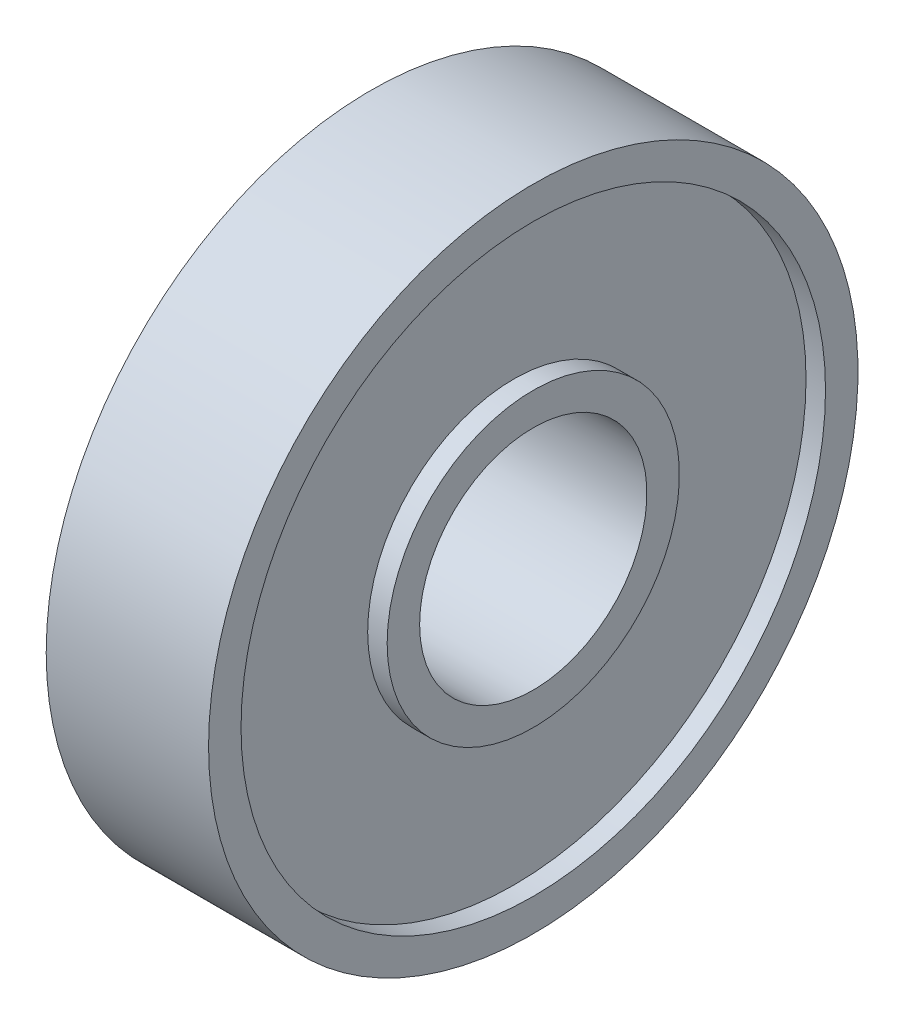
ISO-10303-21;
HEADER;
FILE_DESCRIPTION(('STEP AP214'),'2;1');
FILE_NAME('part.step','',(''),(''),'','','');
FILE_SCHEMA(('AUTOMOTIVE_DESIGN { 1 0 10303 214 1 1 1 1 }'));
ENDSEC;
DATA;
#1=APPLICATION_CONTEXT('core data for automotive mechanical design processes');
#2=APPLICATION_PROTOCOL_DEFINITION('international standard','automotive_design',2000,#1);
#3=PRODUCT_CONTEXT('',#1,'mechanical');
#4=PRODUCT('Part','Part','',(#3));
#5=PRODUCT_RELATED_PRODUCT_CATEGORY('part','',(#4));
#6=PRODUCT_DEFINITION_FORMATION('','',#4);
#7=PRODUCT_DEFINITION_CONTEXT('part definition',#1,'design');
#8=PRODUCT_DEFINITION('design','',#6,#7);
#9=PRODUCT_DEFINITION_SHAPE('','',#8);
#10=(LENGTH_UNIT() NAMED_UNIT(*) SI_UNIT(.MILLI.,.METRE.));
#11=(NAMED_UNIT(*) PLANE_ANGLE_UNIT() SI_UNIT($,.RADIAN.));
#12=(NAMED_UNIT(*) SI_UNIT($,.STERADIAN.) SOLID_ANGLE_UNIT());
#13=UNCERTAINTY_MEASURE_WITH_UNIT(LENGTH_MEASURE(1.E-05),#10,'distance_accuracy_value','');
#14=(GEOMETRIC_REPRESENTATION_CONTEXT(3) GLOBAL_UNCERTAINTY_ASSIGNED_CONTEXT((#13)) GLOBAL_UNIT_ASSIGNED_CONTEXT((#10,
#11,#12)) REPRESENTATION_CONTEXT('',''));
#15=CARTESIAN_POINT('',(0.,0.,0.));
#16=DIRECTION('',(0.,0.,1.));
#17=DIRECTION('',(1.,0.,0.));
#18=AXIS2_PLACEMENT_3D('',#15,#16,#17);
#19=CARTESIAN_POINT('',(3.,45.,0.));
#20=DIRECTION('',(1.,0.,0.));
#21=DIRECTION('',(0.,0.,-1.));
#22=AXIS2_PLACEMENT_3D('',#19,#20,#21);
#23=PLANE('',#22);
#24=CARTESIAN_POINT('',(3.,0.,0.));
#25=DIRECTION('',(-1.,0.,0.));
#26=DIRECTION('',(0.,0.,1.));
#27=AXIS2_PLACEMENT_3D('',#24,#25,#26);
#28=CIRCLE('',#27,22.5);
#29=CARTESIAN_POINT('',(3.,0.,22.5));
#30=VERTEX_POINT('',#29);
#31=EDGE_CURVE('E10',#30,#30,#28,.T.);
#32=ORIENTED_EDGE('',*,*,#31,.F.);
#33=EDGE_LOOP('',(#32));
#34=FACE_BOUND('',#33,.T.);
#35=CARTESIAN_POINT('',(3.,0.,0.));
#36=DIRECTION('',(-1.,0.,0.));
#37=DIRECTION('',(0.,0.,1.));
#38=AXIS2_PLACEMENT_3D('',#35,#36,#37);
#39=CIRCLE('',#38,45.);
#40=CARTESIAN_POINT('',(3.,0.,45.));
#41=VERTEX_POINT('',#40);
#42=EDGE_CURVE('E69',#41,#41,#39,.T.);
#43=ORIENTED_EDGE('',*,*,#42,.T.);
#44=EDGE_LOOP('',(#43));
#45=FACE_BOUND('',#44,.T.);
#46=ADVANCED_FACE('F29',(#34,#45),#23,.F.);
#47=CARTESIAN_POINT('',(-3.79526862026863,0.,0.));
#48=DIRECTION('',(-1.,0.,0.));
#49=DIRECTION('',(0.,0.,1.));
#50=AXIS2_PLACEMENT_3D('',#47,#48,#49);
#51=CYLINDRICAL_SURFACE('',#50,22.5);
#52=CARTESIAN_POINT('',(0.,0.,0.));
#53=DIRECTION('',(-1.,0.,0.));
#54=DIRECTION('',(0.,0.,1.));
#55=AXIS2_PLACEMENT_3D('',#52,#53,#54);
#56=CIRCLE('',#55,22.5);
#57=CARTESIAN_POINT('',(0.,0.,22.5));
#58=VERTEX_POINT('',#57);
#59=EDGE_CURVE('E35',#58,#58,#56,.T.);
#60=ORIENTED_EDGE('',*,*,#59,.F.);
#61=EDGE_LOOP('',(#60));
#62=FACE_BOUND('',#61,.T.);
#63=ORIENTED_EDGE('',*,*,#31,.T.);
#64=EDGE_LOOP('',(#63));
#65=FACE_BOUND('',#64,.T.);
#66=ADVANCED_FACE('F130',(#62,#65),#51,.T.);
#67=CARTESIAN_POINT('',(0.,22.5,0.));
#68=DIRECTION('',(1.,0.,0.));
#69=DIRECTION('',(0.,0.,-1.));
#70=AXIS2_PLACEMENT_3D('',#67,#68,#69);
#71=PLANE('',#70);
#72=CARTESIAN_POINT('',(0.,0.,0.));
#73=DIRECTION('',(-1.,0.,0.));
#74=DIRECTION('',(0.,0.,1.));
#75=AXIS2_PLACEMENT_3D('',#72,#73,#74);
#76=CIRCLE('',#75,17.5);
#77=CARTESIAN_POINT('',(0.,0.,17.5));
#78=VERTEX_POINT('',#77);
#79=EDGE_CURVE('E39',#78,#78,#76,.T.);
#80=ORIENTED_EDGE('',*,*,#79,.F.);
#81=EDGE_LOOP('',(#80));
#82=FACE_BOUND('',#81,.T.);
#83=ORIENTED_EDGE('',*,*,#59,.T.);
#84=EDGE_LOOP('',(#83));
#85=FACE_BOUND('',#84,.T.);
#86=ADVANCED_FACE('F125',(#82,#85),#71,.F.);
#87=CARTESIAN_POINT('',(-3.79526862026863,0.,0.));
#88=DIRECTION('',(-1.,0.,0.));
#89=DIRECTION('',(0.,0.,1.));
#90=AXIS2_PLACEMENT_3D('',#87,#88,#89);
#91=CYLINDRICAL_SURFACE('',#90,17.5);
#92=CARTESIAN_POINT('',(25.,0.,0.));
#93=DIRECTION('',(-1.,0.,0.));
#94=DIRECTION('',(0.,0.,1.));
#95=AXIS2_PLACEMENT_3D('',#92,#93,#94);
#96=CIRCLE('',#95,17.5);
#97=CARTESIAN_POINT('',(25.,0.,17.5));
#98=VERTEX_POINT('',#97);
#99=EDGE_CURVE('E43',#98,#98,#96,.T.);
#100=ORIENTED_EDGE('',*,*,#99,.F.);
#101=EDGE_LOOP('',(#100));
#102=FACE_BOUND('',#101,.T.);
#103=ORIENTED_EDGE('',*,*,#79,.T.);
#104=EDGE_LOOP('',(#103));
#105=FACE_BOUND('',#104,.T.);
#106=ADVANCED_FACE('F119',(#102,#105),#91,.F.);
#107=CARTESIAN_POINT('',(25.,22.5,0.));
#108=DIRECTION('',(-1.,0.,0.));
#109=DIRECTION('',(0.,0.,1.));
#110=AXIS2_PLACEMENT_3D('',#107,#108,#109);
#111=PLANE('',#110);
#112=CARTESIAN_POINT('',(25.,0.,0.));
#113=DIRECTION('',(-1.,0.,0.));
#114=DIRECTION('',(0.,0.,1.));
#115=AXIS2_PLACEMENT_3D('',#112,#113,#114);
#116=CIRCLE('',#115,22.5);
#117=CARTESIAN_POINT('',(25.,0.,22.5));
#118=VERTEX_POINT('',#117);
#119=EDGE_CURVE('E48',#118,#118,#116,.T.);
#120=ORIENTED_EDGE('',*,*,#119,.F.);
#121=EDGE_LOOP('',(#120));
#122=FACE_BOUND('',#121,.T.);
#123=ORIENTED_EDGE('',*,*,#99,.T.);
#124=EDGE_LOOP('',(#123));
#125=FACE_BOUND('',#124,.T.);
#126=ADVANCED_FACE('F113',(#122,#125),#111,.F.);
#127=CARTESIAN_POINT('',(-3.79526862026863,0.,0.));
#128=DIRECTION('',(-1.,0.,0.));
#129=DIRECTION('',(0.,0.,1.));
#130=AXIS2_PLACEMENT_3D('',#127,#128,#129);
#131=CYLINDRICAL_SURFACE('',#130,22.5);
#132=CARTESIAN_POINT('',(22.,0.,0.));
#133=DIRECTION('',(-1.,0.,0.));
#134=DIRECTION('',(0.,0.,1.));
#135=AXIS2_PLACEMENT_3D('',#132,#133,#134);
#136=CIRCLE('',#135,22.5);
#137=CARTESIAN_POINT('',(22.,0.,22.5));
#138=VERTEX_POINT('',#137);
#139=EDGE_CURVE('E51',#138,#138,#136,.T.);
#140=ORIENTED_EDGE('',*,*,#139,.F.);
#141=EDGE_LOOP('',(#140));
#142=FACE_BOUND('',#141,.T.);
#143=ORIENTED_EDGE('',*,*,#119,.T.);
#144=EDGE_LOOP('',(#143));
#145=FACE_BOUND('',#144,.T.);
#146=ADVANCED_FACE('F107',(#142,#145),#131,.T.);
#147=CARTESIAN_POINT('',(22.,45.,0.));
#148=DIRECTION('',(-1.,0.,0.));
#149=DIRECTION('',(0.,0.,1.));
#150=AXIS2_PLACEMENT_3D('',#147,#148,#149);
#151=PLANE('',#150);
#152=CARTESIAN_POINT('',(22.,0.,0.));
#153=DIRECTION('',(-1.,0.,0.));
#154=DIRECTION('',(0.,0.,1.));
#155=AXIS2_PLACEMENT_3D('',#152,#153,#154);
#156=CIRCLE('',#155,45.);
#157=CARTESIAN_POINT('',(22.,0.,45.));
#158=VERTEX_POINT('',#157);
#159=EDGE_CURVE('E54',#158,#158,#156,.T.);
#160=ORIENTED_EDGE('',*,*,#159,.F.);
#161=EDGE_LOOP('',(#160));
#162=FACE_BOUND('',#161,.T.);
#163=ORIENTED_EDGE('',*,*,#139,.T.);
#164=EDGE_LOOP('',(#163));
#165=FACE_BOUND('',#164,.T.);
#166=ADVANCED_FACE('F101',(#162,#165),#151,.F.);
#167=CARTESIAN_POINT('',(-3.79526862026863,0.,0.));
#168=DIRECTION('',(-1.,0.,0.));
#169=DIRECTION('',(0.,0.,1.));
#170=AXIS2_PLACEMENT_3D('',#167,#168,#169);
#171=CYLINDRICAL_SURFACE('',#170,45.);
#172=CARTESIAN_POINT('',(25.,0.,0.));
#173=DIRECTION('',(-1.,0.,0.));
#174=DIRECTION('',(0.,0.,1.));
#175=AXIS2_PLACEMENT_3D('',#172,#173,#174);
#176=CIRCLE('',#175,45.);
#177=CARTESIAN_POINT('',(25.,0.,45.));
#178=VERTEX_POINT('',#177);
#179=EDGE_CURVE('E57',#178,#178,#176,.T.);
#180=ORIENTED_EDGE('',*,*,#179,.F.);
#181=EDGE_LOOP('',(#180));
#182=FACE_BOUND('',#181,.T.);
#183=ORIENTED_EDGE('',*,*,#159,.T.);
#184=EDGE_LOOP('',(#183));
#185=FACE_BOUND('',#184,.T.);
#186=ADVANCED_FACE('F95',(#182,#185),#171,.F.);
#187=CARTESIAN_POINT('',(25.,50.,0.));
#188=DIRECTION('',(-1.,0.,0.));
#189=DIRECTION('',(0.,0.,1.));
#190=AXIS2_PLACEMENT_3D('',#187,#188,#189);
#191=PLANE('',#190);
#192=CARTESIAN_POINT('',(25.,0.,0.));
#193=DIRECTION('',(-1.,0.,0.));
#194=DIRECTION('',(0.,0.,1.));
#195=AXIS2_PLACEMENT_3D('',#192,#193,#194);
#196=CIRCLE('',#195,50.);
#197=CARTESIAN_POINT('',(25.,0.,50.));
#198=VERTEX_POINT('',#197);
#199=EDGE_CURVE('E60',#198,#198,#196,.T.);
#200=ORIENTED_EDGE('',*,*,#199,.F.);
#201=EDGE_LOOP('',(#200));
#202=FACE_BOUND('',#201,.T.);
#203=ORIENTED_EDGE('',*,*,#179,.T.);
#204=EDGE_LOOP('',(#203));
#205=FACE_BOUND('',#204,.T.);
#206=ADVANCED_FACE('F89',(#202,#205),#191,.F.);
#207=CARTESIAN_POINT('',(-3.79526862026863,0.,0.));
#208=DIRECTION('',(-1.,0.,0.));
#209=DIRECTION('',(0.,0.,1.));
#210=AXIS2_PLACEMENT_3D('',#207,#208,#209);
#211=CYLINDRICAL_SURFACE('',#210,50.);
#212=CARTESIAN_POINT('',(0.,0.,0.));
#213=DIRECTION('',(-1.,0.,0.));
#214=DIRECTION('',(0.,0.,1.));
#215=AXIS2_PLACEMENT_3D('',#212,#213,#214);
#216=CIRCLE('',#215,50.);
#217=CARTESIAN_POINT('',(0.,0.,50.));
#218=VERTEX_POINT('',#217);
#219=EDGE_CURVE('E63',#218,#218,#216,.T.);
#220=ORIENTED_EDGE('',*,*,#219,.F.);
#221=EDGE_LOOP('',(#220));
#222=FACE_BOUND('',#221,.T.);
#223=ORIENTED_EDGE('',*,*,#199,.T.);
#224=EDGE_LOOP('',(#223));
#225=FACE_BOUND('',#224,.T.);
#226=ADVANCED_FACE('F83',(#222,#225),#211,.T.);
#227=CARTESIAN_POINT('',(0.,50.,0.));
#228=DIRECTION('',(1.,0.,0.));
#229=DIRECTION('',(0.,0.,-1.));
#230=AXIS2_PLACEMENT_3D('',#227,#228,#229);
#231=PLANE('',#230);
#232=CARTESIAN_POINT('',(0.,0.,0.));
#233=DIRECTION('',(-1.,0.,0.));
#234=DIRECTION('',(0.,0.,1.));
#235=AXIS2_PLACEMENT_3D('',#232,#233,#234);
#236=CIRCLE('',#235,45.);
#237=CARTESIAN_POINT('',(0.,0.,45.));
#238=VERTEX_POINT('',#237);
#239=EDGE_CURVE('E66',#238,#238,#236,.T.);
#240=ORIENTED_EDGE('',*,*,#239,.F.);
#241=EDGE_LOOP('',(#240));
#242=FACE_BOUND('',#241,.T.);
#243=ORIENTED_EDGE('',*,*,#219,.T.);
#244=EDGE_LOOP('',(#243));
#245=FACE_BOUND('',#244,.T.);
#246=ADVANCED_FACE('F77',(#242,#245),#231,.F.);
#247=CARTESIAN_POINT('',(-3.79526862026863,0.,0.));
#248=DIRECTION('',(-1.,0.,0.));
#249=DIRECTION('',(0.,0.,1.));
#250=AXIS2_PLACEMENT_3D('',#247,#248,#249);
#251=CYLINDRICAL_SURFACE('',#250,45.);
#252=ORIENTED_EDGE('',*,*,#42,.F.);
#253=EDGE_LOOP('',(#252));
#254=FACE_BOUND('',#253,.T.);
#255=ORIENTED_EDGE('',*,*,#239,.T.);
#256=EDGE_LOOP('',(#255));
#257=FACE_BOUND('',#256,.T.);
#258=ADVANCED_FACE('F74',(#254,#257),#251,.F.);
#259=CLOSED_SHELL('',(#46,#66,#86,#106,#126,#146,#166,#186,#206,#226,#246,#258));
#260=MANIFOLD_SOLID_BREP('B2',#259);
#261=ADVANCED_BREP_SHAPE_REPRESENTATION('',(#18,#260),#14);
#262=SHAPE_DEFINITION_REPRESENTATION(#9,#261);
ENDSEC;
END-ISO-10303-21;
